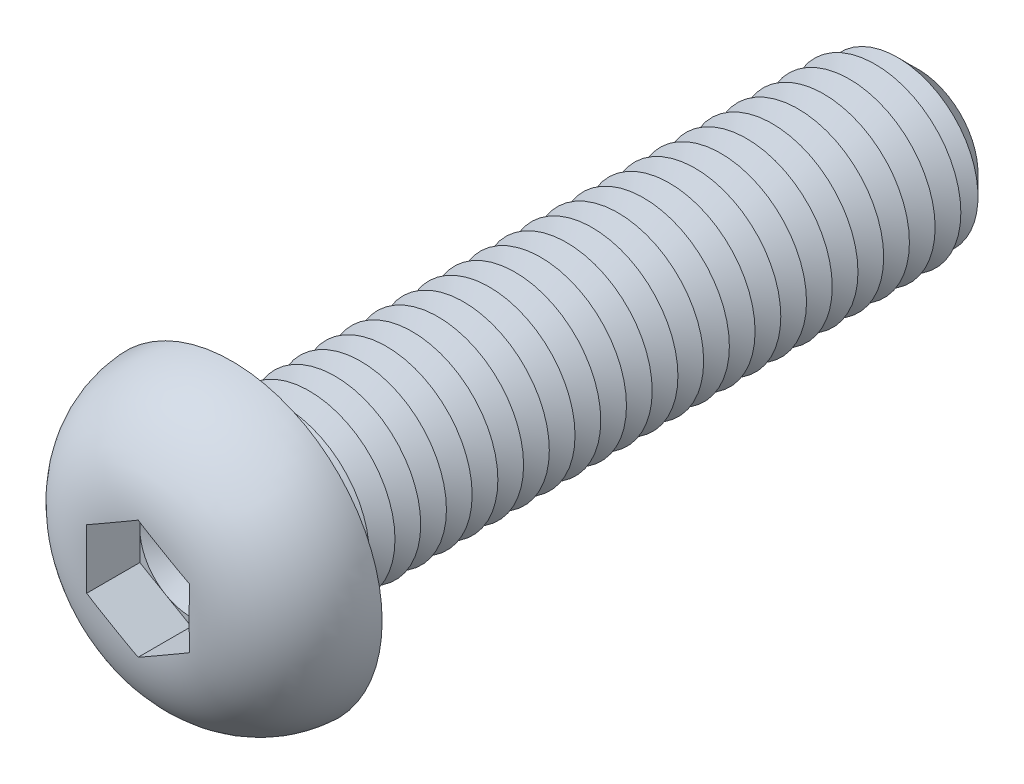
from build123d import *

# Parameters (mm, degrees)
CUT_EXTRUDE1_DEPTH  = 3.12
SKETCH4_R           = 5
BOSS_EXTRUDE1_DEPTH = 40
CHAMFER1_SIZE       = 1.5
LPATTERN1_COUNT     = 25
LPATTERN1_PITCH     = 1.5
FILLET2_R           = 0.6


with BuildPart() as part:
    # Sketch2 → Revolve1 (revolve)
    with BuildSketch(Plane(origin=(0, 0, 0), x_dir=(0, 0, -1), z_dir=(1, 0, 0)), mode=Mode.PRIVATE) as revolve1_sk:
        with BuildLine():
            Line((0, 0), (-5.5, 0))
            Line((-5.5, 0), (-5.5, 2.957763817))
            ThreePointArc((-5.5, 2.957763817), (-3.905948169, 6.951508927), (0, 8.75))
            Line((0, 8.75), (0, 0))
        make_face()
    revolve(revolve1_sk.sketch.rotate(Axis((0, 0, 47.934239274), (0, 0, -1)), 90), axis=Axis((0, 0, 47.934239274), (0, 0, -1)))

    # Sketch3 → Cut-Extrude1 (cut)
    with BuildSketch(Plane.XY.offset(5.5)):
        Polygon((0, 3.464101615), (-3, 1.732050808), (-3, -1.732050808), (0, -3.464101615), (3, -1.732050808), (3, 1.732050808), align=None)
    extrude(amount=-CUT_EXTRUDE1_DEPTH, mode=Mode.SUBTRACT)

    # Sketch4 → Boss-Extrude1 (add)
    with BuildSketch(Plane(origin=(0, 0, 0), x_dir=(-1, 0, 0), z_dir=(0, 0, -1))):
        with Locations(Location((0, 0, 0), (0, 0, 180))):
            Circle(SKETCH4_R)
    extrude(amount=BOSS_EXTRUDE1_DEPTH)

    # Chamfer1
    chamfer1_edges = [part.edges().sort_by_distance(p)[0] for p in [
        (-5, 0, -40),
    ]]
    chamfer(chamfer1_edges, length=CHAMFER1_SIZE)

    # Sketch5 → Cut-Revolve1 (revolve, cut)
    with BuildSketch(Plane(origin=(0, 0, 0), x_dir=(0, 0, -1), z_dir=(1, 0, 0)), mode=Mode.PRIVATE) as cut_revolve1_sk:
        Polygon((1.5, 5), (3, 5), (2.25, 3.700961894), align=None)
    cut_revolve1 = revolve(cut_revolve1_sk.sketch.rotate(Axis((0, 0, 47.934239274), (0, 0, -1)), 90), axis=Axis((0, 0, 47.934239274), (0, 0, -1)), mode=Mode.SUBTRACT)

    # LPattern1: Cut-Revolve1 ×25
    with Locations(*[(0, 0, -i * LPATTERN1_PITCH) for i in range(1, LPATTERN1_COUNT)]):
        add(cut_revolve1, mode=Mode.SUBTRACT)

    # Fillet2
    fillet2_edges = [part.edges().sort_by_distance(p)[0] for p in [
        (-5, 0, 0),
    ]]
    fillet(fillet2_edges, radius=FILLET2_R)

    # Cut-Extrude2 cone 1 section (on through the dimple's axis) → Cut-Extrude2 (revolve, cut)
    with BuildSketch(Plane(origin=(0, 0, 2.38), x_dir=(0, -1, 0), z_dir=(1, 0, 0))):
        Polygon((0, 0), (3, 0), (0, 1.732050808), align=None)
    revolve(axis=Axis((0, 0, 2.38), (0, 0, -1)), mode=Mode.SUBTRACT)


solid = part.part
